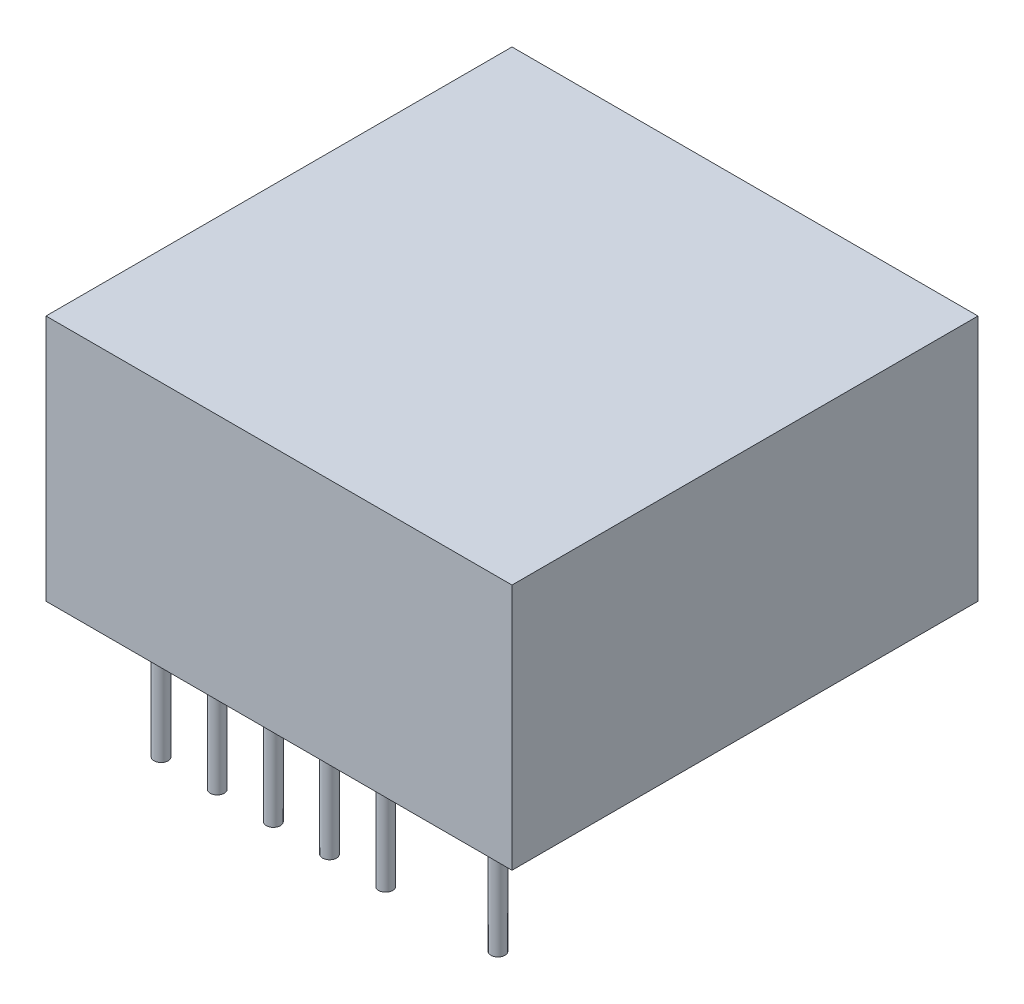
from build123d import *

# Parameters (mm, degrees)
SKETCH1_W           = 21.082
SKETCH1_H           = 21.082
BOSS_EXTRUDE1_DEPTH = 11.176
SKETCH2_R           = 0.3175
BOSS_EXTRUDE2_DEPTH = 5.842


with BuildPart() as part:
    # Sketch1 → Boss-Extrude1 (new body)
    with BuildSketch(Plane(origin=(0, 0, 0), x_dir=(1, 0, 0), z_dir=(0, 1, 0))):
        with Locations((10.541, 10.541)):
            Rectangle(SKETCH1_W, SKETCH1_H)
    extrude(amount=BOSS_EXTRUDE1_DEPTH)

    # Sketch2 → Boss-Extrude2 (add)
    with BuildSketch(Plane.XZ):
        with Locations(Location((2.8575, -2.3495, 0), (0, 0, 270))):
            Circle(SKETCH2_R)
        with Locations(Location((5.3975, -2.3495, 0), (0, 0, 270))):
            Circle(SKETCH2_R)
        with Locations(Location((7.9375, -2.3495, 0), (0, 0, 270))):
            Circle(SKETCH2_R)
        with Locations(Location((10.4775, -2.3495, 0), (0, 0, 270))):
            Circle(SKETCH2_R)
        with Locations(Location((13.0175, -2.3495, 0), (0, 0, 270))):
            Circle(SKETCH2_R)
        with Locations(Location((18.0975, -2.3495, 0), (0, 0, 270))):
            Circle(SKETCH2_R)
    extrude(amount=BOSS_EXTRUDE2_DEPTH)


solid = part.part
